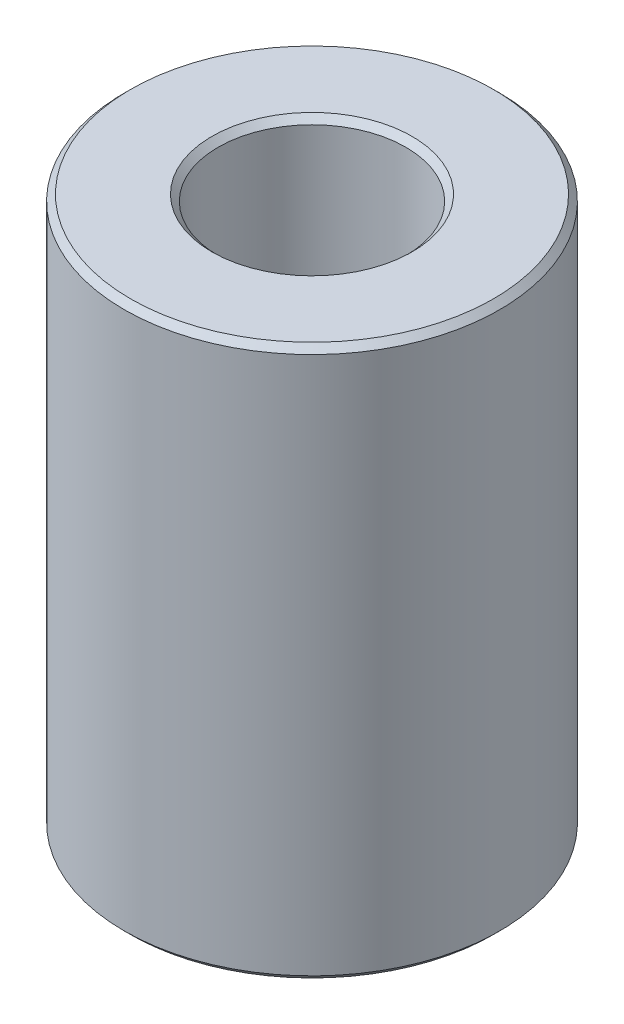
ISO-10303-21;
HEADER;
FILE_DESCRIPTION(('STEP AP214'),'2;1');
FILE_NAME('part.step','',(''),(''),'','','');
FILE_SCHEMA(('AUTOMOTIVE_DESIGN { 1 0 10303 214 1 1 1 1 }'));
ENDSEC;
DATA;
#1=APPLICATION_CONTEXT('core data for automotive mechanical design processes');
#2=APPLICATION_PROTOCOL_DEFINITION('international standard','automotive_design',2000,#1);
#3=PRODUCT_CONTEXT('',#1,'mechanical');
#4=PRODUCT('Part','Part','',(#3));
#5=PRODUCT_RELATED_PRODUCT_CATEGORY('part','',(#4));
#6=PRODUCT_DEFINITION_FORMATION('','',#4);
#7=PRODUCT_DEFINITION_CONTEXT('part definition',#1,'design');
#8=PRODUCT_DEFINITION('design','',#6,#7);
#9=PRODUCT_DEFINITION_SHAPE('','',#8);
#10=(LENGTH_UNIT() NAMED_UNIT(*) SI_UNIT(.MILLI.,.METRE.));
#11=(NAMED_UNIT(*) PLANE_ANGLE_UNIT() SI_UNIT($,.RADIAN.));
#12=(NAMED_UNIT(*) SI_UNIT($,.STERADIAN.) SOLID_ANGLE_UNIT());
#13=UNCERTAINTY_MEASURE_WITH_UNIT(LENGTH_MEASURE(1.E-05),#10,'distance_accuracy_value','');
#14=(GEOMETRIC_REPRESENTATION_CONTEXT(3) GLOBAL_UNCERTAINTY_ASSIGNED_CONTEXT((#13)) GLOBAL_UNIT_ASSIGNED_CONTEXT((#10,
#11,#12)) REPRESENTATION_CONTEXT('',''));
#15=CARTESIAN_POINT('',(0.,0.,0.));
#16=DIRECTION('',(0.,0.,1.));
#17=DIRECTION('',(1.,0.,0.));
#18=AXIS2_PLACEMENT_3D('',#15,#16,#17);
#19=CARTESIAN_POINT('',(-1.89207439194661,0.789999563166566,3.17924878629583));
#20=DIRECTION('',(0.,-1.,0.));
#21=DIRECTION('',(0.,0.,-1.));
#22=AXIS2_PLACEMENT_3D('',#19,#20,#21);
#23=CYLINDRICAL_SURFACE('',#22,2.);
#24=CARTESIAN_POINT('',(-1.89207439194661,-3.11000043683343,3.17924878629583));
#25=DIRECTION('',(0.,1.,0.));
#26=DIRECTION('',(0.,0.,1.));
#27=AXIS2_PLACEMENT_3D('',#24,#25,#26);
#28=CIRCLE('',#27,2.);
#29=CARTESIAN_POINT('',(-1.89207439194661,-3.11000043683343,5.17924878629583));
#30=VERTEX_POINT('',#29);
#31=EDGE_CURVE('P0_E24',#30,#30,#28,.T.);
#32=ORIENTED_EDGE('',*,*,#31,.T.);
#33=EDGE_LOOP('',(#32));
#34=FACE_BOUND('',#33,.T.);
#35=CARTESIAN_POINT('',(-1.89207439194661,0.689999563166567,3.17924878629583));
#36=DIRECTION('',(0.,1.,0.));
#37=DIRECTION('',(0.,0.,1.));
#38=AXIS2_PLACEMENT_3D('',#35,#36,#37);
#39=CIRCLE('',#38,2.);
#40=CARTESIAN_POINT('',(-1.89207439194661,0.689999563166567,5.17924878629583));
#41=VERTEX_POINT('',#40);
#42=EDGE_CURVE('P0_E28',#41,#41,#39,.F.);
#43=ORIENTED_EDGE('',*,*,#42,.T.);
#44=EDGE_LOOP('',(#43));
#45=FACE_BOUND('',#44,.T.);
#46=ADVANCED_FACE('P0_F14',(#34,#45),#23,.T.);
#47=CARTESIAN_POINT('',(-1.89207439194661,0.789999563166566,3.17924878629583));
#48=DIRECTION('',(0.,1.,0.));
#49=DIRECTION('',(0.,0.,1.));
#50=AXIS2_PLACEMENT_3D('',#47,#48,#49);
#51=PLANE('',#50);
#52=CARTESIAN_POINT('',(-1.89207439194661,0.789999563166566,3.17924878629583));
#53=DIRECTION('',(0.,1.,0.));
#54=DIRECTION('',(0.,0.,1.));
#55=AXIS2_PLACEMENT_3D('',#52,#53,#54);
#56=CIRCLE('',#55,1.9);
#57=CARTESIAN_POINT('',(-1.89207439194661,0.789999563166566,5.07924878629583));
#58=VERTEX_POINT('',#57);
#59=EDGE_CURVE('P0_E9',#58,#58,#56,.T.);
#60=ORIENTED_EDGE('',*,*,#59,.T.);
#61=EDGE_LOOP('',(#60));
#62=FACE_BOUND('',#61,.T.);
#63=ADVANCED_FACE('P0_F48',(#62),#51,.T.);
#64=CARTESIAN_POINT('',(-1.89207439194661,-3.21000043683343,3.17924878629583));
#65=DIRECTION('',(0.,1.,0.));
#66=DIRECTION('',(0.,0.,1.));
#67=AXIS2_PLACEMENT_3D('',#64,#65,#66);
#68=PLANE('',#67);
#69=CARTESIAN_POINT('',(-1.89207439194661,-3.21000043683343,3.17924878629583));
#70=DIRECTION('',(0.,1.,0.));
#71=DIRECTION('',(0.,0.,1.));
#72=AXIS2_PLACEMENT_3D('',#69,#70,#71);
#73=CIRCLE('',#72,1.9);
#74=CARTESIAN_POINT('',(-1.89207439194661,-3.21000043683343,5.07924878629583));
#75=VERTEX_POINT('',#74);
#76=EDGE_CURVE('P0_E20',#75,#75,#73,.F.);
#77=ORIENTED_EDGE('',*,*,#76,.T.);
#78=EDGE_LOOP('',(#77));
#79=FACE_BOUND('',#78,.T.);
#80=ADVANCED_FACE('P0_F44',(#79),#68,.F.);
#81=CARTESIAN_POINT('',(-1.89207439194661,-3.11000043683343,3.17924878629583));
#82=DIRECTION('',(0.,1.,0.));
#83=DIRECTION('',(0.,0.,1.));
#84=AXIS2_PLACEMENT_3D('',#81,#82,#83);
#85=TOROIDAL_SURFACE('',#84,1.9,0.1);
#86=ORIENTED_EDGE('',*,*,#76,.F.);
#87=EDGE_LOOP('',(#86));
#88=FACE_BOUND('',#87,.T.);
#89=ORIENTED_EDGE('',*,*,#31,.F.);
#90=EDGE_LOOP('',(#89));
#91=FACE_BOUND('',#90,.T.);
#92=ADVANCED_FACE('P0_F38',(#88,#91),#85,.T.);
#93=CARTESIAN_POINT('',(-1.89207439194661,0.689999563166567,3.17924878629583));
#94=DIRECTION('',(0.,1.,0.));
#95=DIRECTION('',(0.,0.,1.));
#96=AXIS2_PLACEMENT_3D('',#93,#94,#95);
#97=TOROIDAL_SURFACE('',#96,1.9,0.1);
#98=ORIENTED_EDGE('',*,*,#42,.F.);
#99=EDGE_LOOP('',(#98));
#100=FACE_BOUND('',#99,.T.);
#101=ORIENTED_EDGE('',*,*,#59,.F.);
#102=EDGE_LOOP('',(#101));
#103=FACE_BOUND('',#102,.T.);
#104=ADVANCED_FACE('P0_F35',(#100,#103),#97,.T.);
#105=CLOSED_SHELL('',(#46,#63,#80,#92,#104));
#106=MANIFOLD_SOLID_BREP('P0_B1',#105);
#107=CARTESIAN_POINT('',(-1.89207439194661,-3.21000043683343,3.17924878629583));
#108=DIRECTION('',(0.,-1.,0.));
#109=DIRECTION('',(0.,0.,-1.));
#110=AXIS2_PLACEMENT_3D('',#107,#108,#109);
#111=CYLINDRICAL_SURFACE('',#110,1.5);
#112=CARTESIAN_POINT('',(-1.89207439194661,5.48999956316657,3.17924878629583));
#113=DIRECTION('',(0.,1.,0.));
#114=DIRECTION('',(0.,0.,1.));
#115=AXIS2_PLACEMENT_3D('',#112,#113,#114);
#116=CIRCLE('',#115,1.5);
#117=CARTESIAN_POINT('',(-1.89207439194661,5.48999956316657,4.67924878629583));
#118=VERTEX_POINT('',#117);
#119=EDGE_CURVE('P1_E30',#118,#118,#116,.T.);
#120=ORIENTED_EDGE('',*,*,#119,.T.);
#121=EDGE_LOOP('',(#120));
#122=FACE_BOUND('',#121,.T.);
#123=CARTESIAN_POINT('',(-1.89207439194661,1.78999956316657,3.17924878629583));
#124=DIRECTION('',(0.,1.,0.));
#125=DIRECTION('',(0.,0.,1.));
#126=AXIS2_PLACEMENT_3D('',#123,#124,#125);
#127=CIRCLE('',#126,1.5);
#128=CARTESIAN_POINT('',(-1.89207439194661,1.78999956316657,4.67924878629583));
#129=VERTEX_POINT('',#128);
#130=EDGE_CURVE('P1_E62',#129,#129,#127,.F.);
#131=ORIENTED_EDGE('',*,*,#130,.T.);
#132=EDGE_LOOP('',(#131));
#133=FACE_BOUND('',#132,.T.);
#134=ADVANCED_FACE('P1_F15',(#122,#133),#111,.F.);
#135=CARTESIAN_POINT('',(-0.392074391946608,5.58999956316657,3.17924878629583));
#136=DIRECTION('',(0.,1.,0.));
#137=DIRECTION('',(0.,0.,1.));
#138=AXIS2_PLACEMENT_3D('',#135,#136,#137);
#139=PLANE('',#138);
#140=CARTESIAN_POINT('',(-1.89207439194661,5.58999956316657,3.17924878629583));
#141=DIRECTION('',(0.,1.,0.));
#142=DIRECTION('',(0.,0.,1.));
#143=AXIS2_PLACEMENT_3D('',#140,#141,#142);
#144=CIRCLE('',#143,2.9);
#145=CARTESIAN_POINT('',(-1.89207439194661,5.58999956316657,6.07924878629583));
#146=VERTEX_POINT('',#145);
#147=EDGE_CURVE('P1_E35',#146,#146,#144,.T.);
#148=ORIENTED_EDGE('',*,*,#147,.T.);
#149=EDGE_LOOP('',(#148));
#150=FACE_BOUND('',#149,.T.);
#151=CARTESIAN_POINT('',(-1.89207439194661,5.58999956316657,3.17924878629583));
#152=DIRECTION('',(0.,1.,0.));
#153=DIRECTION('',(0.,0.,1.));
#154=AXIS2_PLACEMENT_3D('',#151,#152,#153);
#155=CIRCLE('',#154,1.6);
#156=CARTESIAN_POINT('',(-1.89207439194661,5.58999956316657,4.77924878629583));
#157=VERTEX_POINT('',#156);
#158=EDGE_CURVE('P1_E38',#157,#157,#155,.F.);
#159=ORIENTED_EDGE('',*,*,#158,.T.);
#160=EDGE_LOOP('',(#159));
#161=FACE_BOUND('',#160,.T.);
#162=ADVANCED_FACE('P1_F94',(#150,#161),#139,.T.);
#163=CARTESIAN_POINT('',(-1.89207439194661,-3.21000043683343,3.17924878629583));
#164=DIRECTION('',(0.,-1.,0.));
#165=DIRECTION('',(0.,0.,-1.));
#166=AXIS2_PLACEMENT_3D('',#163,#164,#165);
#167=CYLINDRICAL_SURFACE('',#166,3.);
#168=CARTESIAN_POINT('',(-1.89207439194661,5.48999956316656,3.17924878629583));
#169=DIRECTION('',(0.,1.,0.));
#170=DIRECTION('',(0.,0.,1.));
#171=AXIS2_PLACEMENT_3D('',#168,#169,#170);
#172=CIRCLE('',#171,3.);
#173=CARTESIAN_POINT('',(-1.89207439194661,5.48999956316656,6.17924878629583));
#174=VERTEX_POINT('',#173);
#175=EDGE_CURVE('P1_E41',#174,#174,#172,.F.);
#176=ORIENTED_EDGE('',*,*,#175,.T.);
#177=EDGE_LOOP('',(#176));
#178=FACE_BOUND('',#177,.T.);
#179=CARTESIAN_POINT('',(-1.89207439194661,-3.11000043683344,3.17924878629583));
#180=DIRECTION('',(0.,-1.,0.));
#181=DIRECTION('',(0.,0.,-1.));
#182=AXIS2_PLACEMENT_3D('',#179,#180,#181);
#183=CIRCLE('',#182,3.);
#184=CARTESIAN_POINT('',(-1.89207439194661,-3.11000043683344,0.17924878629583));
#185=VERTEX_POINT('',#184);
#186=EDGE_CURVE('P1_E44',#185,#185,#183,.F.);
#187=ORIENTED_EDGE('',*,*,#186,.T.);
#188=EDGE_LOOP('',(#187));
#189=FACE_BOUND('',#188,.T.);
#190=ADVANCED_FACE('P1_F99',(#178,#189),#167,.T.);
#191=CARTESIAN_POINT('',(0.107925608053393,-3.21000043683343,3.17924878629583));
#192=DIRECTION('',(0.,-1.,0.));
#193=DIRECTION('',(0.,0.,-1.));
#194=AXIS2_PLACEMENT_3D('',#191,#192,#193);
#195=PLANE('',#194);
#196=CARTESIAN_POINT('',(-1.89207439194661,-3.21000043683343,3.17924878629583));
#197=DIRECTION('',(0.,-1.,0.));
#198=DIRECTION('',(0.,0.,-1.));
#199=AXIS2_PLACEMENT_3D('',#196,#197,#198);
#200=CIRCLE('',#199,2.1);
#201=CARTESIAN_POINT('',(-1.89207439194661,-3.21000043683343,1.07924878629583));
#202=VERTEX_POINT('',#201);
#203=EDGE_CURVE('P1_E10',#202,#202,#200,.F.);
#204=ORIENTED_EDGE('',*,*,#203,.T.);
#205=EDGE_LOOP('',(#204));
#206=FACE_BOUND('',#205,.T.);
#207=CARTESIAN_POINT('',(-1.89207439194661,-3.21000043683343,3.17924878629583));
#208=DIRECTION('',(0.,-1.,0.));
#209=DIRECTION('',(0.,0.,-1.));
#210=AXIS2_PLACEMENT_3D('',#207,#208,#209);
#211=CIRCLE('',#210,2.9);
#212=CARTESIAN_POINT('',(-1.89207439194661,-3.21000043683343,0.279248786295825));
#213=VERTEX_POINT('',#212);
#214=EDGE_CURVE('P1_E22',#213,#213,#211,.T.);
#215=ORIENTED_EDGE('',*,*,#214,.T.);
#216=EDGE_LOOP('',(#215));
#217=FACE_BOUND('',#216,.T.);
#218=ADVANCED_FACE('P1_F106',(#206,#217),#195,.T.);
#219=CARTESIAN_POINT('',(-1.89207439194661,-3.21000043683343,3.17924878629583));
#220=DIRECTION('',(0.,-1.,0.));
#221=DIRECTION('',(0.,0.,-1.));
#222=AXIS2_PLACEMENT_3D('',#219,#220,#221);
#223=CYLINDRICAL_SURFACE('',#222,2.);
#224=CARTESIAN_POINT('',(-1.89207439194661,-3.11000043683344,3.17924878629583));
#225=DIRECTION('',(0.,-1.,0.));
#226=DIRECTION('',(0.,0.,-1.));
#227=AXIS2_PLACEMENT_3D('',#224,#225,#226);
#228=CIRCLE('',#227,2.);
#229=CARTESIAN_POINT('',(-1.89207439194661,-3.11000043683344,1.17924878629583));
#230=VERTEX_POINT('',#229);
#231=EDGE_CURVE('P1_E26',#230,#230,#228,.T.);
#232=ORIENTED_EDGE('',*,*,#231,.T.);
#233=EDGE_LOOP('',(#232));
#234=FACE_BOUND('',#233,.T.);
#235=CARTESIAN_POINT('',(-1.89207439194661,0.889999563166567,3.17924878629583));
#236=DIRECTION('',(0.,-1.,0.));
#237=DIRECTION('',(0.,0.,-1.));
#238=AXIS2_PLACEMENT_3D('',#235,#236,#237);
#239=CIRCLE('',#238,2.);
#240=CARTESIAN_POINT('',(-1.89207439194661,0.889999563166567,1.17924878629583));
#241=VERTEX_POINT('',#240);
#242=EDGE_CURVE('P1_E65',#241,#241,#239,.F.);
#243=ORIENTED_EDGE('',*,*,#242,.T.);
#244=EDGE_LOOP('',(#243));
#245=FACE_BOUND('',#244,.T.);
#246=ADVANCED_FACE('P1_F110',(#234,#245),#223,.F.);
#247=CARTESIAN_POINT('',(0.107925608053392,1.08999956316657,3.17924878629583));
#248=DIRECTION('',(0.,-1.,0.));
#249=DIRECTION('',(0.,0.,-1.));
#250=AXIS2_PLACEMENT_3D('',#247,#248,#249);
#251=PLANE('',#250);
#252=CARTESIAN_POINT('',(-1.89207439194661,1.08999956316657,3.17924878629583));
#253=DIRECTION('',(0.,-1.,0.));
#254=DIRECTION('',(0.,0.,-1.));
#255=AXIS2_PLACEMENT_3D('',#252,#253,#254);
#256=CIRCLE('',#255,1.1);
#257=CARTESIAN_POINT('',(-1.89207439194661,1.08999956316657,2.07924878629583));
#258=VERTEX_POINT('',#257);
#259=EDGE_CURVE('P1_E47',#258,#258,#256,.F.);
#260=ORIENTED_EDGE('',*,*,#259,.T.);
#261=EDGE_LOOP('',(#260));
#262=FACE_BOUND('',#261,.T.);
#263=CARTESIAN_POINT('',(-1.89207439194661,1.08999956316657,3.17924878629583));
#264=DIRECTION('',(0.,-1.,0.));
#265=DIRECTION('',(0.,0.,-1.));
#266=AXIS2_PLACEMENT_3D('',#263,#264,#265);
#267=CIRCLE('',#266,1.8);
#268=CARTESIAN_POINT('',(-1.89207439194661,1.08999956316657,1.37924878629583));
#269=VERTEX_POINT('',#268);
#270=EDGE_CURVE('P1_E68',#269,#269,#267,.T.);
#271=ORIENTED_EDGE('',*,*,#270,.T.);
#272=EDGE_LOOP('',(#271));
#273=FACE_BOUND('',#272,.T.);
#274=ADVANCED_FACE('P1_F72',(#262,#273),#251,.T.);
#275=CARTESIAN_POINT('',(-1.89207439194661,-3.21000043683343,3.17924878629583));
#276=DIRECTION('',(0.,-1.,0.));
#277=DIRECTION('',(0.,0.,-1.));
#278=AXIS2_PLACEMENT_3D('',#275,#276,#277);
#279=CYLINDRICAL_SURFACE('',#278,1.);
#280=CARTESIAN_POINT('',(-1.89207439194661,1.48999956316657,3.17924878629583));
#281=DIRECTION('',(0.,1.,0.));
#282=DIRECTION('',(0.,0.,1.));
#283=AXIS2_PLACEMENT_3D('',#280,#281,#282);
#284=CIRCLE('',#283,1.);
#285=CARTESIAN_POINT('',(-1.89207439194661,1.48999956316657,4.17924878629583));
#286=VERTEX_POINT('',#285);
#287=EDGE_CURVE('P1_E50',#286,#286,#284,.T.);
#288=ORIENTED_EDGE('',*,*,#287,.T.);
#289=EDGE_LOOP('',(#288));
#290=FACE_BOUND('',#289,.T.);
#291=CARTESIAN_POINT('',(-1.89207439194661,1.18999956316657,3.17924878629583));
#292=DIRECTION('',(0.,-1.,0.));
#293=DIRECTION('',(0.,0.,-1.));
#294=AXIS2_PLACEMENT_3D('',#291,#292,#293);
#295=CIRCLE('',#294,1.);
#296=CARTESIAN_POINT('',(-1.89207439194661,1.18999956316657,2.17924878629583));
#297=VERTEX_POINT('',#296);
#298=EDGE_CURVE('P1_E53',#297,#297,#295,.T.);
#299=ORIENTED_EDGE('',*,*,#298,.T.);
#300=EDGE_LOOP('',(#299));
#301=FACE_BOUND('',#300,.T.);
#302=ADVANCED_FACE('P1_F88',(#290,#301),#279,.F.);
#303=CARTESIAN_POINT('',(-0.392074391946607,1.58999956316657,3.17924878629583));
#304=DIRECTION('',(0.,1.,0.));
#305=DIRECTION('',(0.,0.,1.));
#306=AXIS2_PLACEMENT_3D('',#303,#304,#305);
#307=PLANE('',#306);
#308=CARTESIAN_POINT('',(-1.89207439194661,1.58999956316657,3.17924878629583));
#309=DIRECTION('',(0.,1.,0.));
#310=DIRECTION('',(0.,0.,1.));
#311=AXIS2_PLACEMENT_3D('',#308,#309,#310);
#312=CIRCLE('',#311,1.1);
#313=CARTESIAN_POINT('',(-1.89207439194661,1.58999956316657,4.27924878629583));
#314=VERTEX_POINT('',#313);
#315=EDGE_CURVE('P1_E56',#314,#314,#312,.F.);
#316=ORIENTED_EDGE('',*,*,#315,.T.);
#317=EDGE_LOOP('',(#316));
#318=FACE_BOUND('',#317,.T.);
#319=CARTESIAN_POINT('',(-1.89207439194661,1.58999956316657,3.17924878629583));
#320=DIRECTION('',(0.,1.,0.));
#321=DIRECTION('',(0.,0.,1.));
#322=AXIS2_PLACEMENT_3D('',#319,#320,#321);
#323=CIRCLE('',#322,1.3);
#324=CARTESIAN_POINT('',(-1.89207439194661,1.58999956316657,4.47924878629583));
#325=VERTEX_POINT('',#324);
#326=EDGE_CURVE('P1_E59',#325,#325,#323,.T.);
#327=ORIENTED_EDGE('',*,*,#326,.T.);
#328=EDGE_LOOP('',(#327));
#329=FACE_BOUND('',#328,.T.);
#330=ADVANCED_FACE('P1_F77',(#318,#329),#307,.T.);
#331=CARTESIAN_POINT('',(-1.89207439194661,0.889999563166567,3.17924878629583));
#332=DIRECTION('',(0.,-1.,0.));
#333=DIRECTION('',(0.,0.,-1.));
#334=AXIS2_PLACEMENT_3D('',#331,#332,#333);
#335=TOROIDAL_SURFACE('',#334,1.8,0.2);
#336=ORIENTED_EDGE('',*,*,#242,.F.);
#337=EDGE_LOOP('',(#336));
#338=FACE_BOUND('',#337,.T.);
#339=ORIENTED_EDGE('',*,*,#270,.F.);
#340=EDGE_LOOP('',(#339));
#341=FACE_BOUND('',#340,.T.);
#342=ADVANCED_FACE('P1_F74',(#338,#341),#335,.F.);
#343=CARTESIAN_POINT('',(-1.89207439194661,1.78999956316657,3.17924878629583));
#344=DIRECTION('',(0.,1.,0.));
#345=DIRECTION('',(0.,0.,1.));
#346=AXIS2_PLACEMENT_3D('',#343,#344,#345);
#347=TOROIDAL_SURFACE('',#346,1.3,0.2);
#348=ORIENTED_EDGE('',*,*,#326,.F.);
#349=EDGE_LOOP('',(#348));
#350=FACE_BOUND('',#349,.T.);
#351=ORIENTED_EDGE('',*,*,#130,.F.);
#352=EDGE_LOOP('',(#351));
#353=FACE_BOUND('',#352,.T.);
#354=ADVANCED_FACE('P1_F76',(#350,#353),#347,.F.);
#355=CARTESIAN_POINT('',(-1.89207439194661,1.58999956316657,3.17924878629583));
#356=DIRECTION('',(0.,1.,0.));
#357=DIRECTION('',(0.,0.,1.));
#358=AXIS2_PLACEMENT_3D('',#355,#356,#357);
#359=CONICAL_SURFACE('',#358,1.1,0.785398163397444);
#360=ORIENTED_EDGE('',*,*,#287,.F.);
#361=EDGE_LOOP('',(#360));
#362=FACE_BOUND('',#361,.T.);
#363=ORIENTED_EDGE('',*,*,#315,.F.);
#364=EDGE_LOOP('',(#363));
#365=FACE_BOUND('',#364,.T.);
#366=ADVANCED_FACE('P1_F85',(#362,#365),#359,.F.);
#367=CARTESIAN_POINT('',(-1.89207439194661,1.18999956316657,3.17924878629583));
#368=DIRECTION('',(0.,-1.,0.));
#369=DIRECTION('',(0.,0.,-1.));
#370=AXIS2_PLACEMENT_3D('',#367,#368,#369);
#371=CONICAL_SURFACE('',#370,1.,0.785398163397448);
#372=ORIENTED_EDGE('',*,*,#259,.F.);
#373=EDGE_LOOP('',(#372));
#374=FACE_BOUND('',#373,.T.);
#375=ORIENTED_EDGE('',*,*,#298,.F.);
#376=EDGE_LOOP('',(#375));
#377=FACE_BOUND('',#376,.T.);
#378=ADVANCED_FACE('P1_F125',(#374,#377),#371,.F.);
#379=CARTESIAN_POINT('',(-1.89207439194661,5.48999956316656,3.17924878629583));
#380=DIRECTION('',(0.,-1.,0.));
#381=DIRECTION('',(0.,0.,-1.));
#382=AXIS2_PLACEMENT_3D('',#379,#380,#381);
#383=CONICAL_SURFACE('',#382,3.,0.78539816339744);
#384=ORIENTED_EDGE('',*,*,#147,.F.);
#385=EDGE_LOOP('',(#384));
#386=FACE_BOUND('',#385,.T.);
#387=ORIENTED_EDGE('',*,*,#175,.F.);
#388=EDGE_LOOP('',(#387));
#389=FACE_BOUND('',#388,.T.);
#390=ADVANCED_FACE('P1_F127',(#386,#389),#383,.T.);
#391=CARTESIAN_POINT('',(-1.89207439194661,5.58999956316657,3.17924878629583));
#392=DIRECTION('',(0.,1.,0.));
#393=DIRECTION('',(0.,0.,1.));
#394=AXIS2_PLACEMENT_3D('',#391,#392,#393);
#395=CONICAL_SURFACE('',#394,1.6,0.785398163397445);
#396=ORIENTED_EDGE('',*,*,#119,.F.);
#397=EDGE_LOOP('',(#396));
#398=FACE_BOUND('',#397,.T.);
#399=ORIENTED_EDGE('',*,*,#158,.F.);
#400=EDGE_LOOP('',(#399));
#401=FACE_BOUND('',#400,.T.);
#402=ADVANCED_FACE('P1_F134',(#398,#401),#395,.F.);
#403=CARTESIAN_POINT('',(-1.89207439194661,-3.11000043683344,3.17924878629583));
#404=DIRECTION('',(0.,-1.,0.));
#405=DIRECTION('',(0.,0.,-1.));
#406=AXIS2_PLACEMENT_3D('',#403,#404,#405);
#407=CONICAL_SURFACE('',#406,2.,0.785398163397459);
#408=CARTESIAN_POINT('',(-1.89207439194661,-3.21000043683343,1.07924878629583));
#409=CARTESIAN_POINT('',(-1.89207439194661,-3.20895877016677,1.0802904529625));
#410=CARTESIAN_POINT('',(-1.89207439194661,-3.2079171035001,1.08133211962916));
#411=CARTESIAN_POINT('',(-1.89207439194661,-3.20583377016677,1.0834154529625));
#412=CARTESIAN_POINT('',(-1.89207439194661,-3.2047921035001,1.08445711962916));
#413=CARTESIAN_POINT('',(-1.89207439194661,-3.20270877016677,1.0865404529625));
#414=CARTESIAN_POINT('',(-1.89207439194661,-3.2016671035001,1.08758211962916));
#415=CARTESIAN_POINT('',(-1.89207439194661,-3.19958377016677,1.0896654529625));
#416=CARTESIAN_POINT('',(-1.89207439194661,-3.1985421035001,1.09070711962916));
#417=CARTESIAN_POINT('',(-1.89207439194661,-3.19645877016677,1.0927904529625));
#418=CARTESIAN_POINT('',(-1.89207439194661,-3.1954171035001,1.09383211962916));
#419=CARTESIAN_POINT('',(-1.89207439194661,-3.19333377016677,1.0959154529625));
#420=CARTESIAN_POINT('',(-1.89207439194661,-3.1922921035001,1.09695711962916));
#421=CARTESIAN_POINT('',(-1.89207439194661,-3.19020877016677,1.0990404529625));
#422=CARTESIAN_POINT('',(-1.89207439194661,-3.1891671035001,1.10008211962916));
#423=CARTESIAN_POINT('',(-1.89207439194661,-3.18708377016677,1.1021654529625));
#424=CARTESIAN_POINT('',(-1.89207439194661,-3.1860421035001,1.10320711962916));
#425=CARTESIAN_POINT('',(-1.89207439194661,-3.18395877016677,1.1052904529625));
#426=CARTESIAN_POINT('',(-1.89207439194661,-3.1829171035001,1.10633211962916));
#427=CARTESIAN_POINT('',(-1.89207439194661,-3.18083377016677,1.1084154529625));
#428=CARTESIAN_POINT('',(-1.89207439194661,-3.1797921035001,1.10945711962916));
#429=CARTESIAN_POINT('',(-1.89207439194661,-3.17770877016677,1.1115404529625));
#430=CARTESIAN_POINT('',(-1.89207439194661,-3.1766671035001,1.11258211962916));
#431=CARTESIAN_POINT('',(-1.89207439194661,-3.17458377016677,1.1146654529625));
#432=CARTESIAN_POINT('',(-1.89207439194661,-3.1735421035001,1.11570711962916));
#433=CARTESIAN_POINT('',(-1.89207439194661,-3.17145877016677,1.1177904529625));
#434=CARTESIAN_POINT('',(-1.89207439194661,-3.1704171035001,1.11883211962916));
#435=CARTESIAN_POINT('',(-1.89207439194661,-3.16833377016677,1.1209154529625));
#436=CARTESIAN_POINT('',(-1.89207439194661,-3.1672921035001,1.12195711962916));
#437=CARTESIAN_POINT('',(-1.89207439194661,-3.16520877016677,1.1240404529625));
#438=CARTESIAN_POINT('',(-1.89207439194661,-3.1641671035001,1.12508211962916));
#439=CARTESIAN_POINT('',(-1.89207439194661,-3.16208377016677,1.1271654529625));
#440=CARTESIAN_POINT('',(-1.89207439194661,-3.1610421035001,1.12820711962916));
#441=CARTESIAN_POINT('',(-1.89207439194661,-3.15895877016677,1.1302904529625));
#442=CARTESIAN_POINT('',(-1.89207439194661,-3.1579171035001,1.13133211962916));
#443=CARTESIAN_POINT('',(-1.89207439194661,-3.15583377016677,1.1334154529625));
#444=CARTESIAN_POINT('',(-1.89207439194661,-3.1547921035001,1.13445711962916));
#445=CARTESIAN_POINT('',(-1.89207439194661,-3.15270877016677,1.1365404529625));
#446=CARTESIAN_POINT('',(-1.89207439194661,-3.1516671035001,1.13758211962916));
#447=CARTESIAN_POINT('',(-1.89207439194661,-3.14958377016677,1.1396654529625));
#448=CARTESIAN_POINT('',(-1.89207439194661,-3.1485421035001,1.14070711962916));
#449=CARTESIAN_POINT('',(-1.89207439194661,-3.14645877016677,1.1427904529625));
#450=CARTESIAN_POINT('',(-1.89207439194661,-3.1454171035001,1.14383211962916));
#451=CARTESIAN_POINT('',(-1.89207439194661,-3.14333377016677,1.1459154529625));
#452=CARTESIAN_POINT('',(-1.89207439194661,-3.1422921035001,1.14695711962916));
#453=CARTESIAN_POINT('',(-1.89207439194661,-3.14020877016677,1.1490404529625));
#454=CARTESIAN_POINT('',(-1.89207439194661,-3.1391671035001,1.15008211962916));
#455=CARTESIAN_POINT('',(-1.89207439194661,-3.13708377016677,1.1521654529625));
#456=CARTESIAN_POINT('',(-1.89207439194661,-3.1360421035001,1.15320711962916));
#457=CARTESIAN_POINT('',(-1.89207439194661,-3.13395877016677,1.1552904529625));
#458=CARTESIAN_POINT('',(-1.89207439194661,-3.1329171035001,1.15633211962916));
#459=CARTESIAN_POINT('',(-1.89207439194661,-3.13083377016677,1.1584154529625));
#460=CARTESIAN_POINT('',(-1.89207439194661,-3.1297921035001,1.15945711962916));
#461=CARTESIAN_POINT('',(-1.89207439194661,-3.12770877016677,1.1615404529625));
#462=CARTESIAN_POINT('',(-1.89207439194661,-3.1266671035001,1.16258211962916));
#463=CARTESIAN_POINT('',(-1.89207439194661,-3.12458377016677,1.1646654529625));
#464=CARTESIAN_POINT('',(-1.89207439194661,-3.1235421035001,1.16570711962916));
#465=CARTESIAN_POINT('',(-1.89207439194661,-3.12145877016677,1.1677904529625));
#466=CARTESIAN_POINT('',(-1.89207439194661,-3.1204171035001,1.16883211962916));
#467=CARTESIAN_POINT('',(-1.89207439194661,-3.11833377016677,1.1709154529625));
#468=CARTESIAN_POINT('',(-1.89207439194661,-3.1172921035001,1.17195711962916));
#469=CARTESIAN_POINT('',(-1.89207439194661,-3.11520877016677,1.1740404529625));
#470=CARTESIAN_POINT('',(-1.89207439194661,-3.1141671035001,1.17508211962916));
#471=CARTESIAN_POINT('',(-1.89207439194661,-3.11208377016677,1.1771654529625));
#472=CARTESIAN_POINT('',(-1.89207439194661,-3.1110421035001,1.17820711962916));
#473=CARTESIAN_POINT('',(-1.89207439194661,-3.11000043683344,1.17924878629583));
#474=B_SPLINE_CURVE_WITH_KNOTS('',3,(#408,#409,#410,#411,#412,#413,#414,#415,#416,#417,#418,
#419,#420,#421,#422,#423,#424,#425,#426,#427,#428,#429,#430,#431,#432,#433,#434,#435,#436,#437,
#438,#439,#440,#441,#442,#443,#444,#445,#446,#447,#448,#449,#450,#451,#452,#453,#454,#455,#456,
#457,#458,#459,#460,#461,#462,#463,#464,#465,#466,#467,#468,#469,#470,#471,#472,#473),
.UNSPECIFIED.,.F.,.F.,(4,2,2,2,2,2,2,2,2,2,2,2,2,2,2,2,2,2,2,2,2,2,2,2,2,2,2,2,2,2,2,2,4),(0.,
0.00441941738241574,0.00883883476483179,0.0132582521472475,0.0176776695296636,
0.0220970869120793,0.0265165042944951,0.0309359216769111,0.0353553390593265,0.0397747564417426,
0.0441941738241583,0.0486135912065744,0.0530330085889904,0.0574524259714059,0.0618718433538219,
0.0662912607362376,0.0707106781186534,0.0751300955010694,0.0795495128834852,0.0839689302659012,
0.088388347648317,0.0928077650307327,0.0972271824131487,0.101646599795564,0.10606601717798,
0.110485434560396,0.114904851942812,0.119324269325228,0.123743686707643,0.12816310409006,
0.132582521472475,0.137001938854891,0.141421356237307),.UNSPECIFIED.);
#475=EDGE_CURVE('P1_BSEAM142',#202,#230,#474,.T.);
#476=ORIENTED_EDGE('',*,*,#203,.F.);
#477=ORIENTED_EDGE('',*,*,#231,.F.);
#478=ORIENTED_EDGE('',*,*,#475,.T.);
#479=ORIENTED_EDGE('',*,*,#475,.F.);
#480=EDGE_LOOP('',(#476,#478,#477,#479));
#481=FACE_BOUND('',#480,.T.);
#482=ADVANCED_FACE('P1_F142',(#481),#407,.F.);
#483=CARTESIAN_POINT('',(-1.89207439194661,-3.21000043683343,3.17924878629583));
#484=DIRECTION('',(0.,1.,0.));
#485=DIRECTION('',(0.,0.,1.));
#486=AXIS2_PLACEMENT_3D('',#483,#484,#485);
#487=CONICAL_SURFACE('',#486,2.9,0.785398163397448);
#488=ORIENTED_EDGE('',*,*,#186,.F.);
#489=EDGE_LOOP('',(#488));
#490=FACE_BOUND('',#489,.T.);
#491=ORIENTED_EDGE('',*,*,#214,.F.);
#492=EDGE_LOOP('',(#491));
#493=FACE_BOUND('',#492,.T.);
#494=ADVANCED_FACE('P1_F17',(#490,#493),#487,.T.);
#495=CLOSED_SHELL('',(#134,#162,#190,#218,#246,#274,#302,#330,#342,#354,#366,#378,#390,#402,
#482,#494));
#496=MANIFOLD_SOLID_BREP('P1_B1',#495);
#497=ADVANCED_BREP_SHAPE_REPRESENTATION('',(#18,#106,#496),#14);
#498=SHAPE_DEFINITION_REPRESENTATION(#9,#497);
ENDSEC;
END-ISO-10303-21;
